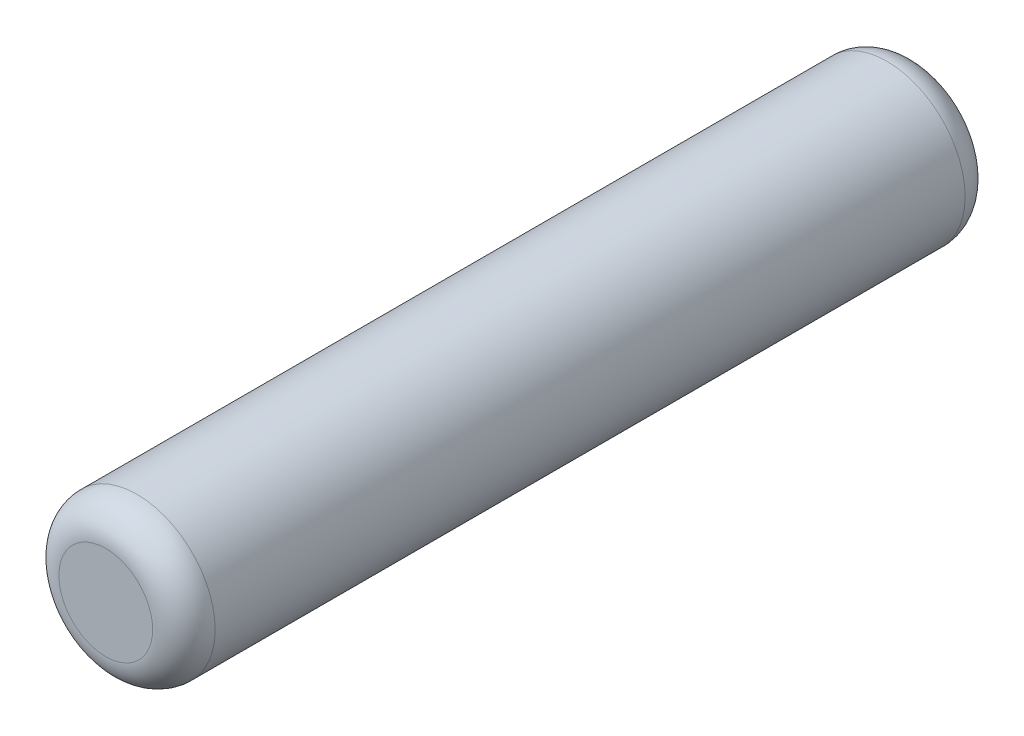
ISO-10303-21;
HEADER;
FILE_DESCRIPTION(('STEP AP214'),'2;1');
FILE_NAME('part.step','',(''),(''),'','','');
FILE_SCHEMA(('AUTOMOTIVE_DESIGN { 1 0 10303 214 1 1 1 1 }'));
ENDSEC;
DATA;
#1=APPLICATION_CONTEXT('core data for automotive mechanical design processes');
#2=APPLICATION_PROTOCOL_DEFINITION('international standard','automotive_design',2000,#1);
#3=PRODUCT_CONTEXT('',#1,'mechanical');
#4=PRODUCT('Part','Part','',(#3));
#5=PRODUCT_RELATED_PRODUCT_CATEGORY('part','',(#4));
#6=PRODUCT_DEFINITION_FORMATION('','',#4);
#7=PRODUCT_DEFINITION_CONTEXT('part definition',#1,'design');
#8=PRODUCT_DEFINITION('design','',#6,#7);
#9=PRODUCT_DEFINITION_SHAPE('','',#8);
#10=(LENGTH_UNIT() NAMED_UNIT(*) SI_UNIT(.MILLI.,.METRE.));
#11=(NAMED_UNIT(*) PLANE_ANGLE_UNIT() SI_UNIT($,.RADIAN.));
#12=(NAMED_UNIT(*) SI_UNIT($,.STERADIAN.) SOLID_ANGLE_UNIT());
#13=UNCERTAINTY_MEASURE_WITH_UNIT(LENGTH_MEASURE(1.E-05),#10,'distance_accuracy_value','');
#14=(GEOMETRIC_REPRESENTATION_CONTEXT(3) GLOBAL_UNCERTAINTY_ASSIGNED_CONTEXT((#13)) GLOBAL_UNIT_ASSIGNED_CONTEXT((#10,
#11,#12)) REPRESENTATION_CONTEXT('',''));
#15=CARTESIAN_POINT('',(0.,0.,0.));
#16=DIRECTION('',(0.,0.,1.));
#17=DIRECTION('',(1.,0.,0.));
#18=AXIS2_PLACEMENT_3D('',#15,#16,#17);
#19=CARTESIAN_POINT('',(0.,0.,6.5));
#20=DIRECTION('',(0.,0.,-1.));
#21=DIRECTION('',(-1.,0.,0.));
#22=AXIS2_PLACEMENT_3D('',#19,#20,#21);
#23=CYLINDRICAL_SURFACE('',#22,1.25);
#24=CARTESIAN_POINT('',(0.,0.,-6.));
#25=DIRECTION('',(0.,0.,1.));
#26=DIRECTION('',(1.,0.,0.));
#27=AXIS2_PLACEMENT_3D('',#24,#25,#26);
#28=CIRCLE('',#27,1.25);
#29=CARTESIAN_POINT('',(-1.25,0.,-6.00000000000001));
#30=VERTEX_POINT('',#29);
#31=EDGE_CURVE('E40',#30,#30,#28,.T.);
#32=CARTESIAN_POINT('',(0.,0.,6.));
#33=DIRECTION('',(0.,0.,1.));
#34=DIRECTION('',(1.,0.,0.));
#35=AXIS2_PLACEMENT_3D('',#32,#33,#34);
#36=CIRCLE('',#35,1.25);
#37=CARTESIAN_POINT('',(-1.25,0.,6.));
#38=VERTEX_POINT('',#37);
#39=EDGE_CURVE('E44',#38,#38,#36,.F.);
#40=CARTESIAN_POINT('',(-1.25,0.,-6.00000000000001));
#41=CARTESIAN_POINT('',(-1.25,0.,-5.87500000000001));
#42=CARTESIAN_POINT('',(-1.25,0.,-5.75000000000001));
#43=CARTESIAN_POINT('',(-1.25,0.,-5.50000000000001));
#44=CARTESIAN_POINT('',(-1.25,0.,-5.37500000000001));
#45=CARTESIAN_POINT('',(-1.25,0.,-5.12500000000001));
#46=CARTESIAN_POINT('',(-1.25,0.,-5.00000000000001));
#47=CARTESIAN_POINT('',(-1.25,0.,-4.75000000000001));
#48=CARTESIAN_POINT('',(-1.25,0.,-4.62500000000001));
#49=CARTESIAN_POINT('',(-1.25,0.,-4.375));
#50=CARTESIAN_POINT('',(-1.25,0.,-4.25));
#51=CARTESIAN_POINT('',(-1.25,0.,-4.));
#52=CARTESIAN_POINT('',(-1.25,0.,-3.875));
#53=CARTESIAN_POINT('',(-1.25,0.,-3.625));
#54=CARTESIAN_POINT('',(-1.25,0.,-3.5));
#55=CARTESIAN_POINT('',(-1.25,0.,-3.25));
#56=CARTESIAN_POINT('',(-1.25,0.,-3.125));
#57=CARTESIAN_POINT('',(-1.25,0.,-2.875));
#58=CARTESIAN_POINT('',(-1.25,0.,-2.75));
#59=CARTESIAN_POINT('',(-1.25,0.,-2.5));
#60=CARTESIAN_POINT('',(-1.25,0.,-2.375));
#61=CARTESIAN_POINT('',(-1.25,0.,-2.125));
#62=CARTESIAN_POINT('',(-1.25,0.,-2.));
#63=CARTESIAN_POINT('',(-1.25,0.,-1.75));
#64=CARTESIAN_POINT('',(-1.25,0.,-1.625));
#65=CARTESIAN_POINT('',(-1.25,0.,-1.375));
#66=CARTESIAN_POINT('',(-1.25,0.,-1.25));
#67=CARTESIAN_POINT('',(-1.25,0.,-1.));
#68=CARTESIAN_POINT('',(-1.25,0.,-0.875000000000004));
#69=CARTESIAN_POINT('',(-1.25,0.,-0.625000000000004));
#70=CARTESIAN_POINT('',(-1.25,0.,-0.500000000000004));
#71=CARTESIAN_POINT('',(-1.25,0.,-0.250000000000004));
#72=CARTESIAN_POINT('',(-1.25,0.,-0.125000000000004));
#73=CARTESIAN_POINT('',(-1.25,0.,0.124999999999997));
#74=CARTESIAN_POINT('',(-1.25,0.,0.249999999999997));
#75=CARTESIAN_POINT('',(-1.25,0.,0.499999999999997));
#76=CARTESIAN_POINT('',(-1.25,0.,0.624999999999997));
#77=CARTESIAN_POINT('',(-1.25,0.,0.874999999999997));
#78=CARTESIAN_POINT('',(-1.25,0.,0.999999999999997));
#79=CARTESIAN_POINT('',(-1.25,0.,1.25));
#80=CARTESIAN_POINT('',(-1.25,0.,1.375));
#81=CARTESIAN_POINT('',(-1.25,0.,1.625));
#82=CARTESIAN_POINT('',(-1.25,0.,1.75));
#83=CARTESIAN_POINT('',(-1.25,0.,2.));
#84=CARTESIAN_POINT('',(-1.25,0.,2.125));
#85=CARTESIAN_POINT('',(-1.25,0.,2.375));
#86=CARTESIAN_POINT('',(-1.25,0.,2.5));
#87=CARTESIAN_POINT('',(-1.25,0.,2.75));
#88=CARTESIAN_POINT('',(-1.25,0.,2.875));
#89=CARTESIAN_POINT('',(-1.25,0.,3.125));
#90=CARTESIAN_POINT('',(-1.25,0.,3.25));
#91=CARTESIAN_POINT('',(-1.25,0.,3.5));
#92=CARTESIAN_POINT('',(-1.25,0.,3.625));
#93=CARTESIAN_POINT('',(-1.25,0.,3.875));
#94=CARTESIAN_POINT('',(-1.25,0.,4.));
#95=CARTESIAN_POINT('',(-1.25,0.,4.25));
#96=CARTESIAN_POINT('',(-1.25,0.,4.375));
#97=CARTESIAN_POINT('',(-1.25,0.,4.625));
#98=CARTESIAN_POINT('',(-1.25,0.,4.75));
#99=CARTESIAN_POINT('',(-1.25,0.,5.));
#100=CARTESIAN_POINT('',(-1.25,0.,5.125));
#101=CARTESIAN_POINT('',(-1.25,0.,5.375));
#102=CARTESIAN_POINT('',(-1.25,0.,5.5));
#103=CARTESIAN_POINT('',(-1.25,0.,5.75));
#104=CARTESIAN_POINT('',(-1.25,0.,5.875));
#105=CARTESIAN_POINT('',(-1.25,0.,6.));
#106=B_SPLINE_CURVE_WITH_KNOTS('',3,(#40,#41,#42,#43,#44,#45,#46,#47,#48,#49,#50,#51,#52,#53,
#54,#55,#56,#57,#58,#59,#60,#61,#62,#63,#64,#65,#66,#67,#68,#69,#70,#71,#72,#73,#74,#75,#76,#77,
#78,#79,#80,#81,#82,#83,#84,#85,#86,#87,#88,#89,#90,#91,#92,#93,#94,#95,#96,#97,#98,#99,#100,
#101,#102,#103,#104,#105),.UNSPECIFIED.,.F.,.F.,(4,2,2,2,2,2,2,2,2,2,2,2,2,2,2,2,2,2,2,2,2,2,2,
2,2,2,2,2,2,2,2,2,4),(0.,0.375,0.750000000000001,1.125,1.5,1.875,2.25,2.625,3.,3.375,3.75,4.125,
4.5,4.875,5.25,5.625,6.,6.375,6.75,7.125,7.5,7.875,8.25,8.625,9.,9.375,9.75,10.125,10.5,10.875,
11.25,11.625,12.),.UNSPECIFIED.);
#107=EDGE_CURVE('BSEAM29',#30,#38,#106,.T.);
#108=ORIENTED_EDGE('',*,*,#31,.T.);
#109=ORIENTED_EDGE('',*,*,#39,.T.);
#110=ORIENTED_EDGE('',*,*,#107,.T.);
#111=ORIENTED_EDGE('',*,*,#107,.F.);
#112=EDGE_LOOP('',(#108,#110,#109,#111));
#113=FACE_BOUND('',#112,.T.);
#114=ADVANCED_FACE('F29',(#113),#23,.T.);
#115=CARTESIAN_POINT('',(0.,0.,6.5));
#116=DIRECTION('',(0.,0.,1.));
#117=DIRECTION('',(1.,0.,0.));
#118=AXIS2_PLACEMENT_3D('',#115,#116,#117);
#119=PLANE('',#118);
#120=CARTESIAN_POINT('',(0.,0.,6.5));
#121=DIRECTION('',(0.,0.,1.));
#122=DIRECTION('',(1.,0.,0.));
#123=AXIS2_PLACEMENT_3D('',#120,#121,#122);
#124=CIRCLE('',#123,0.75);
#125=CARTESIAN_POINT('',(0.75,0.,6.5));
#126=VERTEX_POINT('',#125);
#127=EDGE_CURVE('E10',#126,#126,#124,.T.);
#128=ORIENTED_EDGE('',*,*,#127,.T.);
#129=EDGE_LOOP('',(#128));
#130=FACE_BOUND('',#129,.T.);
#131=ADVANCED_FACE('F60',(#130),#119,.T.);
#132=CARTESIAN_POINT('',(0.,0.,-6.5));
#133=DIRECTION('',(0.,0.,1.));
#134=DIRECTION('',(1.,0.,0.));
#135=AXIS2_PLACEMENT_3D('',#132,#133,#134);
#136=PLANE('',#135);
#137=CARTESIAN_POINT('',(0.,0.,-6.5));
#138=DIRECTION('',(0.,0.,1.));
#139=DIRECTION('',(1.,0.,0.));
#140=AXIS2_PLACEMENT_3D('',#137,#138,#139);
#141=CIRCLE('',#140,0.75);
#142=CARTESIAN_POINT('',(0.75,0.,-6.5));
#143=VERTEX_POINT('',#142);
#144=EDGE_CURVE('E36',#143,#143,#141,.F.);
#145=ORIENTED_EDGE('',*,*,#144,.T.);
#146=EDGE_LOOP('',(#145));
#147=FACE_BOUND('',#146,.T.);
#148=ADVANCED_FACE('F57',(#147),#136,.F.);
#149=CARTESIAN_POINT('',(0.,0.,-6.));
#150=DIRECTION('',(0.,0.,1.));
#151=DIRECTION('',(1.,0.,0.));
#152=AXIS2_PLACEMENT_3D('',#149,#150,#151);
#153=TOROIDAL_SURFACE('',#152,0.75,0.5);
#154=ORIENTED_EDGE('',*,*,#144,.F.);
#155=EDGE_LOOP('',(#154));
#156=FACE_BOUND('',#155,.T.);
#157=ORIENTED_EDGE('',*,*,#31,.F.);
#158=EDGE_LOOP('',(#157));
#159=FACE_BOUND('',#158,.T.);
#160=ADVANCED_FACE('F53',(#156,#159),#153,.T.);
#161=CARTESIAN_POINT('',(0.,0.,6.));
#162=DIRECTION('',(0.,0.,1.));
#163=DIRECTION('',(1.,0.,0.));
#164=AXIS2_PLACEMENT_3D('',#161,#162,#163);
#165=TOROIDAL_SURFACE('',#164,0.75,0.5);
#166=ORIENTED_EDGE('',*,*,#39,.F.);
#167=EDGE_LOOP('',(#166));
#168=FACE_BOUND('',#167,.T.);
#169=ORIENTED_EDGE('',*,*,#127,.F.);
#170=EDGE_LOOP('',(#169));
#171=FACE_BOUND('',#170,.T.);
#172=ADVANCED_FACE('F31',(#168,#171),#165,.T.);
#173=CLOSED_SHELL('',(#114,#131,#148,#160,#172));
#174=MANIFOLD_SOLID_BREP('B2',#173);
#175=ADVANCED_BREP_SHAPE_REPRESENTATION('',(#18,#174),#14);
#176=SHAPE_DEFINITION_REPRESENTATION(#9,#175);
ENDSEC;
END-ISO-10303-21;
